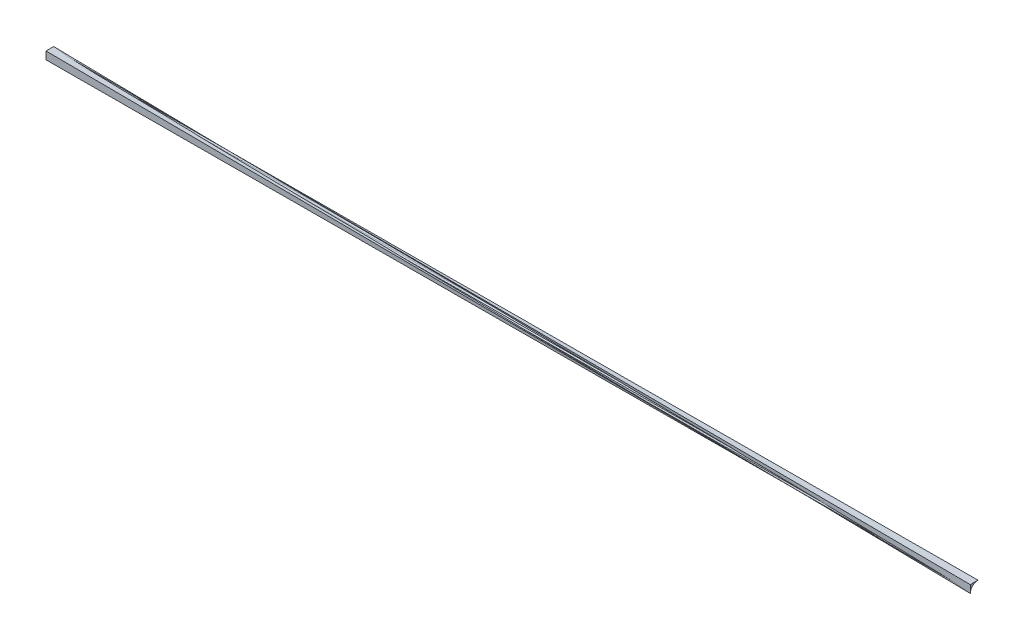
ISO-10303-21;
HEADER;
FILE_DESCRIPTION(('STEP AP214'),'2;1');
FILE_NAME('part.step','',(''),(''),'','','');
FILE_SCHEMA(('AUTOMOTIVE_DESIGN { 1 0 10303 214 1 1 1 1 }'));
ENDSEC;
DATA;
#1=APPLICATION_CONTEXT('core data for automotive mechanical design processes');
#2=APPLICATION_PROTOCOL_DEFINITION('international standard','automotive_design',2000,#1);
#3=PRODUCT_CONTEXT('',#1,'mechanical');
#4=PRODUCT('Part','Part','',(#3));
#5=PRODUCT_RELATED_PRODUCT_CATEGORY('part','',(#4));
#6=PRODUCT_DEFINITION_FORMATION('','',#4);
#7=PRODUCT_DEFINITION_CONTEXT('part definition',#1,'design');
#8=PRODUCT_DEFINITION('design','',#6,#7);
#9=PRODUCT_DEFINITION_SHAPE('','',#8);
#10=(LENGTH_UNIT() NAMED_UNIT(*) SI_UNIT(.MILLI.,.METRE.));
#11=(NAMED_UNIT(*) PLANE_ANGLE_UNIT() SI_UNIT($,.RADIAN.));
#12=(NAMED_UNIT(*) SI_UNIT($,.STERADIAN.) SOLID_ANGLE_UNIT());
#13=UNCERTAINTY_MEASURE_WITH_UNIT(LENGTH_MEASURE(1.E-05),#10,'distance_accuracy_value','');
#14=(GEOMETRIC_REPRESENTATION_CONTEXT(3) GLOBAL_UNCERTAINTY_ASSIGNED_CONTEXT((#13)) GLOBAL_UNIT_ASSIGNED_CONTEXT((#10,
#11,#12)) REPRESENTATION_CONTEXT('',''));
#15=CARTESIAN_POINT('',(0.,0.,0.));
#16=DIRECTION('',(0.,0.,1.));
#17=DIRECTION('',(1.,0.,0.));
#18=AXIS2_PLACEMENT_3D('',#15,#16,#17);
#19=CARTESIAN_POINT('',(304.8,0.,0.));
#20=DIRECTION('',(1.,0.,0.));
#21=DIRECTION('',(0.,0.,-1.));
#22=AXIS2_PLACEMENT_3D('',#19,#20,#21);
#23=PLANE('',#22);
#24=DIRECTION('',(0.,0.,1.));
#25=VECTOR('',#24,1.);
#26=CARTESIAN_POINT('',(304.8,76.2,73.025));
#27=LINE('',#26,#25);
#28=CARTESIAN_POINT('',(304.8,76.2,73.025));
#29=VERTEX_POINT('',#28);
#30=CARTESIAN_POINT('',(304.8,76.2,76.2));
#31=VERTEX_POINT('',#30);
#32=EDGE_CURVE('E48',#29,#31,#27,.T.);
#33=ORIENTED_EDGE('',*,*,#32,.T.);
#34=DIRECTION('',(0.,-1.,0.));
#35=VECTOR('',#34,1.);
#36=CARTESIAN_POINT('',(304.8,76.2,76.2));
#37=LINE('',#36,#35);
#38=CARTESIAN_POINT('',(304.8,73.025,76.2));
#39=VERTEX_POINT('',#38);
#40=EDGE_CURVE('E183',#31,#39,#37,.T.);
#41=ORIENTED_EDGE('',*,*,#40,.T.);
#42=DIRECTION('',(0.,0.995184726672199,-0.0980171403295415));
#43=VECTOR('',#42,1.);
#44=CARTESIAN_POINT('',(304.8,73.025,76.2));
#45=LINE('',#44,#43);
#46=CARTESIAN_POINT('',(304.8,73.6444117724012,76.1389932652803));
#47=VERTEX_POINT('',#46);
#48=EDGE_CURVE('E189',#39,#47,#45,.T.);
#49=ORIENTED_EDGE('',*,*,#48,.T.);
#50=DIRECTION('',(0.,0.956940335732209,-0.290284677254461));
#51=VECTOR('',#50,1.);
#52=CARTESIAN_POINT('',(304.8,73.6444117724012,76.1389932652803));
#53=LINE('',#52,#51);
#54=CARTESIAN_POINT('',(304.8,74.2400198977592,75.9583175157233));
#55=VERTEX_POINT('',#54);
#56=EDGE_CURVE('E150',#47,#55,#53,.T.);
#57=ORIENTED_EDGE('',*,*,#56,.T.);
#58=DIRECTION('',(0.,0.881921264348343,-0.47139673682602));
#59=VECTOR('',#58,1.);
#60=CARTESIAN_POINT('',(304.8,74.2400198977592,75.9583175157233));
#61=LINE('',#60,#59);
#62=CARTESIAN_POINT('',(304.8,74.7889354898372,75.6649160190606));
#63=VERTEX_POINT('',#62);
#64=EDGE_CURVE('E194',#55,#63,#61,.T.);
#65=ORIENTED_EDGE('',*,*,#64,.T.);
#66=DIRECTION('',(0.,0.773010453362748,-0.634393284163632));
#67=VECTOR('',#66,1.);
#68=CARTESIAN_POINT('',(304.8,74.7889354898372,75.6649160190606));
#69=LINE('',#68,#67);
#70=CARTESIAN_POINT('',(304.8,75.2700640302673,75.2700640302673));
#71=VERTEX_POINT('',#70);
#72=EDGE_CURVE('E197',#63,#71,#69,.T.);
#73=ORIENTED_EDGE('',*,*,#72,.T.);
#74=DIRECTION('',(0.,0.634393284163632,-0.773010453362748));
#75=VECTOR('',#74,1.);
#76=CARTESIAN_POINT('',(304.8,75.2700640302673,75.2700640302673));
#77=LINE('',#76,#75);
#78=CARTESIAN_POINT('',(304.8,75.6649160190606,74.7889354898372));
#79=VERTEX_POINT('',#78);
#80=EDGE_CURVE('E203',#71,#79,#77,.T.);
#81=ORIENTED_EDGE('',*,*,#80,.T.);
#82=DIRECTION('',(0.,0.47139673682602,-0.881921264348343));
#83=VECTOR('',#82,1.);
#84=CARTESIAN_POINT('',(304.8,75.6649160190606,74.7889354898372));
#85=LINE('',#84,#83);
#86=CARTESIAN_POINT('',(304.8,75.9583175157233,74.2400198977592));
#87=VERTEX_POINT('',#86);
#88=EDGE_CURVE('E202',#79,#87,#85,.T.);
#89=ORIENTED_EDGE('',*,*,#88,.T.);
#90=DIRECTION('',(0.,0.290284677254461,-0.956940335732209));
#91=VECTOR('',#90,1.);
#92=CARTESIAN_POINT('',(304.8,75.9583175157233,74.2400198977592));
#93=LINE('',#92,#91);
#94=CARTESIAN_POINT('',(304.8,76.1389932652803,73.6444117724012));
#95=VERTEX_POINT('',#94);
#96=EDGE_CURVE('E53',#87,#95,#93,.T.);
#97=ORIENTED_EDGE('',*,*,#96,.T.);
#98=DIRECTION('',(0.,0.0980171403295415,-0.995184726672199));
#99=VECTOR('',#98,1.);
#100=CARTESIAN_POINT('',(304.8,76.1389932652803,73.6444117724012));
#101=LINE('',#100,#99);
#102=EDGE_CURVE('E11',#95,#29,#101,.T.);
#103=ORIENTED_EDGE('',*,*,#102,.T.);
#104=EDGE_LOOP('',(#33,#41,#49,#57,#65,#73,#81,#89,#97,#103));
#105=FACE_BOUND('',#104,.T.);
#106=ADVANCED_FACE('F44',(#105),#23,.T.);
#107=CARTESIAN_POINT('',(0.,0.,0.));
#108=DIRECTION('',(1.,0.,0.));
#109=DIRECTION('',(0.,0.,-1.));
#110=AXIS2_PLACEMENT_3D('',#107,#108,#109);
#111=PLANE('',#110);
#112=DIRECTION('',(0.,0.,1.));
#113=VECTOR('',#112,1.);
#114=CARTESIAN_POINT('',(0.,152.4,149.225));
#115=LINE('',#114,#113);
#116=CARTESIAN_POINT('',(0.,152.4,149.225));
#117=VERTEX_POINT('',#116);
#118=CARTESIAN_POINT('',(0.,152.4,152.4));
#119=VERTEX_POINT('',#118);
#120=EDGE_CURVE('E122',#117,#119,#115,.T.);
#121=ORIENTED_EDGE('',*,*,#120,.F.);
#122=DIRECTION('',(0.,0.0980171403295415,-0.995184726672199));
#123=VECTOR('',#122,1.);
#124=CARTESIAN_POINT('',(0.,152.33899326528,149.844411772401));
#125=LINE('',#124,#123);
#126=CARTESIAN_POINT('',(0.,152.33899326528,149.844411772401));
#127=VERTEX_POINT('',#126);
#128=EDGE_CURVE('E156',#127,#117,#125,.T.);
#129=ORIENTED_EDGE('',*,*,#128,.F.);
#130=DIRECTION('',(0.,0.290284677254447,-0.956940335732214));
#131=VECTOR('',#130,1.);
#132=CARTESIAN_POINT('',(0.,152.158317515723,150.440019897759));
#133=LINE('',#132,#131);
#134=CARTESIAN_POINT('',(0.,152.158317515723,150.440019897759));
#135=VERTEX_POINT('',#134);
#136=EDGE_CURVE('E232',#135,#127,#133,.T.);
#137=ORIENTED_EDGE('',*,*,#136,.F.);
#138=DIRECTION('',(0.,0.47139673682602,-0.881921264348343));
#139=VECTOR('',#138,1.);
#140=CARTESIAN_POINT('',(0.,151.864916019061,150.988935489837));
#141=LINE('',#140,#139);
#142=CARTESIAN_POINT('',(0.,151.864916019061,150.988935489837));
#143=VERTEX_POINT('',#142);
#144=EDGE_CURVE('E227',#143,#135,#141,.T.);
#145=ORIENTED_EDGE('',*,*,#144,.F.);
#146=DIRECTION('',(0.,0.634393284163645,-0.773010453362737));
#147=VECTOR('',#146,1.);
#148=CARTESIAN_POINT('',(0.,151.470064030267,151.470064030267));
#149=LINE('',#148,#147);
#150=CARTESIAN_POINT('',(0.,151.470064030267,151.470064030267));
#151=VERTEX_POINT('',#150);
#152=EDGE_CURVE('E219',#151,#143,#149,.T.);
#153=ORIENTED_EDGE('',*,*,#152,.F.);
#154=DIRECTION('',(0.,0.773010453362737,-0.634393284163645));
#155=VECTOR('',#154,1.);
#156=CARTESIAN_POINT('',(0.,150.988935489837,151.864916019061));
#157=LINE('',#156,#155);
#158=CARTESIAN_POINT('',(0.,150.988935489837,151.864916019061));
#159=VERTEX_POINT('',#158);
#160=EDGE_CURVE('E220',#159,#151,#157,.T.);
#161=ORIENTED_EDGE('',*,*,#160,.F.);
#162=DIRECTION('',(0.,0.881921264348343,-0.47139673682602));
#163=VECTOR('',#162,1.);
#164=CARTESIAN_POINT('',(0.,150.440019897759,152.158317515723));
#165=LINE('',#164,#163);
#166=CARTESIAN_POINT('',(0.,150.440019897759,152.158317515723));
#167=VERTEX_POINT('',#166);
#168=EDGE_CURVE('E222',#167,#159,#165,.T.);
#169=ORIENTED_EDGE('',*,*,#168,.F.);
#170=DIRECTION('',(0.,0.956940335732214,-0.290284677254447));
#171=VECTOR('',#170,1.);
#172=CARTESIAN_POINT('',(0.,149.844411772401,152.33899326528));
#173=LINE('',#172,#171);
#174=CARTESIAN_POINT('',(0.,149.844411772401,152.33899326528));
#175=VERTEX_POINT('',#174);
#176=EDGE_CURVE('E229',#175,#167,#173,.T.);
#177=ORIENTED_EDGE('',*,*,#176,.F.);
#178=DIRECTION('',(0.,0.995184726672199,-0.0980171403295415));
#179=VECTOR('',#178,1.);
#180=CARTESIAN_POINT('',(0.,149.225,152.4));
#181=LINE('',#180,#179);
#182=CARTESIAN_POINT('',(0.,149.225,152.4));
#183=VERTEX_POINT('',#182);
#184=EDGE_CURVE('E130',#183,#175,#181,.T.);
#185=ORIENTED_EDGE('',*,*,#184,.F.);
#186=DIRECTION('',(0.,-1.,0.));
#187=VECTOR('',#186,1.);
#188=CARTESIAN_POINT('',(0.,152.4,152.4));
#189=LINE('',#188,#187);
#190=EDGE_CURVE('E121',#119,#183,#189,.T.);
#191=ORIENTED_EDGE('',*,*,#190,.F.);
#192=EDGE_LOOP('',(#121,#129,#137,#145,#153,#161,#169,#177,#185,#191));
#193=FACE_BOUND('',#192,.T.);
#194=ADVANCED_FACE('F123',(#193),#111,.F.);
#195=CARTESIAN_POINT('',(0.,152.4,149.225));
#196=CARTESIAN_POINT('',(304.8,73.025,76.2));
#197=CARTESIAN_POINT('',(0.,152.4,149.754166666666));
#198=CARTESIAN_POINT('',(304.8,73.1282352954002,76.18983221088));
#199=CARTESIAN_POINT('',(0.,152.4,150.283333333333));
#200=CARTESIAN_POINT('',(304.8,73.2314705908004,76.1796644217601));
#201=CARTESIAN_POINT('',(0.,152.4,151.341666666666));
#202=CARTESIAN_POINT('',(304.8,73.4379411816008,76.1593288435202));
#203=CARTESIAN_POINT('',(0.,152.4,151.870833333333));
#204=CARTESIAN_POINT('',(304.8,73.541176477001,76.1491610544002));
#205=CARTESIAN_POINT('',(0.,152.4,152.4));
#206=CARTESIAN_POINT('',(304.8,73.6444117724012,76.1389932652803));
#207=B_SPLINE_SURFACE_WITH_KNOTS('',3,1,((#195,#196),(#197,#198),(#199,#200),(#201,#202),(#203,
#204),(#205,#206)),.UNSPECIFIED.,.F.,.F.,.F.,(4,2,4),(2,2),(0.,0.5,1.),(0.,1.),.UNSPECIFIED.);
#208=DIRECTION('',(0.940986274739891,-0.243136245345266,-0.23543491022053));
#209=VECTOR('',#208,1.);
#210=CARTESIAN_POINT('',(152.4,113.022205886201,114.26949663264));
#211=LINE('',#210,#209);
#212=EDGE_CURVE('E139',#119,#47,#211,.T.);
#213=DIRECTION('',(-0.942718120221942,0.245499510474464,0.225859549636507));
#214=VECTOR('',#213,1.);
#215=CARTESIAN_POINT('',(152.4,112.7125,112.7125));
#216=LINE('',#215,#214);
#217=EDGE_CURVE('E143',#39,#117,#216,.T.);
#218=ORIENTED_EDGE('',*,*,#120,.T.);
#219=ORIENTED_EDGE('',*,*,#212,.T.);
#220=ORIENTED_EDGE('',*,*,#48,.F.);
#221=ORIENTED_EDGE('',*,*,#217,.T.);
#222=EDGE_LOOP('',(#218,#219,#220,#221));
#223=FACE_BOUND('',#222,.T.);
#224=ADVANCED_FACE('F137',(#223),#207,.T.);
#225=CARTESIAN_POINT('',(0.,152.4,152.4));
#226=CARTESIAN_POINT('',(304.8,73.6444117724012,76.1389932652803));
#227=CARTESIAN_POINT('',(0.,151.870833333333,152.4));
#228=CARTESIAN_POINT('',(304.8,73.7436797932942,76.1088806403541));
#229=CARTESIAN_POINT('',(0.,151.341666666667,152.4));
#230=CARTESIAN_POINT('',(304.8,73.8429478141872,76.0787680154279));
#231=CARTESIAN_POINT('',(0.,150.283333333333,152.4));
#232=CARTESIAN_POINT('',(304.8,74.0414838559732,76.0185427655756));
#233=CARTESIAN_POINT('',(0.,149.754166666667,152.4));
#234=CARTESIAN_POINT('',(304.8,74.1407518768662,75.9884301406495));
#235=CARTESIAN_POINT('',(0.,149.225,152.4));
#236=CARTESIAN_POINT('',(304.8,74.2400198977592,75.9583175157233));
#237=B_SPLINE_SURFACE_WITH_KNOTS('',3,1,((#225,#226),(#227,#228),(#229,#230),(#231,#232),(#233,
#234),(#235,#236)),.UNSPECIFIED.,.F.,.F.,.F.,(4,2,4),(2,2),(0.,0.5,1.),(0.,1.),.UNSPECIFIED.);
#238=DIRECTION('',(0.943471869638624,-0.232107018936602,-0.236616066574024));
#239=VECTOR('',#238,1.);
#240=CARTESIAN_POINT('',(152.4,111.73250994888,114.179158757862));
#241=LINE('',#240,#239);
#242=EDGE_CURVE('E149',#183,#55,#241,.T.);
#243=ORIENTED_EDGE('',*,*,#190,.T.);
#244=ORIENTED_EDGE('',*,*,#242,.T.);
#245=ORIENTED_EDGE('',*,*,#56,.F.);
#246=ORIENTED_EDGE('',*,*,#212,.F.);
#247=EDGE_LOOP('',(#243,#244,#245,#246));
#248=FACE_BOUND('',#247,.T.);
#249=ADVANCED_FACE('F144',(#248),#237,.T.);
#250=CARTESIAN_POINT('',(0.,152.33899326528,149.844411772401));
#251=CARTESIAN_POINT('',(304.8,76.2,76.2));
#252=CARTESIAN_POINT('',(0.,152.3491610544,149.741176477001));
#253=CARTESIAN_POINT('',(304.8,75.6708333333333,76.2));
#254=CARTESIAN_POINT('',(0.,152.35932884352,149.637941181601));
#255=CARTESIAN_POINT('',(304.8,75.1416666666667,76.2));
#256=CARTESIAN_POINT('',(0.,152.37966442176,149.4314705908));
#257=CARTESIAN_POINT('',(304.8,74.0833333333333,76.2));
#258=CARTESIAN_POINT('',(0.,152.38983221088,149.3282352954));
#259=CARTESIAN_POINT('',(304.8,73.5541666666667,76.2));
#260=CARTESIAN_POINT('',(0.,152.4,149.225));
#261=CARTESIAN_POINT('',(304.8,73.025,76.2));
#262=B_SPLINE_SURFACE_WITH_KNOTS('',3,1,((#250,#251),(#252,#253),(#254,#255),(#256,#257),(#258,
#259),(#260,#261)),.UNSPECIFIED.,.F.,.F.,.F.,(4,2,4),(2,2),(0.,0.5,1.),(0.,1.),.UNSPECIFIED.);
#263=DIRECTION('',(0.944583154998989,-0.235956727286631,-0.228225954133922));
#264=VECTOR('',#263,1.);
#265=CARTESIAN_POINT('',(152.4,114.26949663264,113.022205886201));
#266=LINE('',#265,#264);
#267=EDGE_CURVE('E182',#127,#31,#266,.T.);
#268=ORIENTED_EDGE('',*,*,#128,.T.);
#269=ORIENTED_EDGE('',*,*,#217,.F.);
#270=ORIENTED_EDGE('',*,*,#40,.F.);
#271=ORIENTED_EDGE('',*,*,#267,.F.);
#272=EDGE_LOOP('',(#268,#269,#270,#271));
#273=FACE_BOUND('',#272,.T.);
#274=ADVANCED_FACE('F245',(#273),#262,.T.);
#275=CARTESIAN_POINT('',(0.,149.225,152.4));
#276=CARTESIAN_POINT('',(304.8,74.2400198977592,75.9583175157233));
#277=CARTESIAN_POINT('',(0.,149.3282352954,152.38983221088));
#278=CARTESIAN_POINT('',(304.8,74.3315058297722,75.9094172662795));
#279=CARTESIAN_POINT('',(0.,149.4314705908,152.37966442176));
#280=CARTESIAN_POINT('',(304.8,74.4229917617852,75.8605170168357));
#281=CARTESIAN_POINT('',(0.,149.637941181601,152.35932884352));
#282=CARTESIAN_POINT('',(304.8,74.6059636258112,75.7627165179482));
#283=CARTESIAN_POINT('',(0.,149.741176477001,152.3491610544));
#284=CARTESIAN_POINT('',(304.8,74.6974495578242,75.7138162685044));
#285=CARTESIAN_POINT('',(0.,149.844411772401,152.33899326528));
#286=CARTESIAN_POINT('',(304.8,74.7889354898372,75.6649160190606));
#287=B_SPLINE_SURFACE_WITH_KNOTS('',3,1,((#275,#276),(#277,#278),(#279,#280),(#281,#282),(#283,
#284),(#285,#286)),.UNSPECIFIED.,.F.,.F.,.F.,(4,2,4),(2,2),(0.,0.5,1.),(0.,1.),.UNSPECIFIED.);
#288=DIRECTION('',(0.943263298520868,-0.232273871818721,-0.237282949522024));
#289=VECTOR('',#288,1.);
#290=CARTESIAN_POINT('',(152.4,112.316673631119,114.00195464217));
#291=LINE('',#290,#289);
#292=EDGE_CURVE('E152',#175,#63,#291,.T.);
#293=ORIENTED_EDGE('',*,*,#184,.T.);
#294=ORIENTED_EDGE('',*,*,#292,.T.);
#295=ORIENTED_EDGE('',*,*,#64,.F.);
#296=ORIENTED_EDGE('',*,*,#242,.F.);
#297=EDGE_LOOP('',(#293,#294,#295,#296));
#298=FACE_BOUND('',#297,.T.);
#299=ADVANCED_FACE('F292',(#298),#287,.T.);
#300=CARTESIAN_POINT('',(0.,149.844411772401,152.33899326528));
#301=CARTESIAN_POINT('',(304.8,74.7889354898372,75.6649160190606));
#302=CARTESIAN_POINT('',(0.,149.943679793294,152.308880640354));
#303=CARTESIAN_POINT('',(304.8,74.8691235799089,75.5991073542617));
#304=CARTESIAN_POINT('',(0.,150.042947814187,152.278768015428));
#305=CARTESIAN_POINT('',(304.8,74.9493116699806,75.5332986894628));
#306=CARTESIAN_POINT('',(0.,150.241483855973,152.218542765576));
#307=CARTESIAN_POINT('',(304.8,75.1096878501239,75.4016813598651));
#308=CARTESIAN_POINT('',(0.,150.340751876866,152.18843014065));
#309=CARTESIAN_POINT('',(304.8,75.1898759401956,75.3358726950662));
#310=CARTESIAN_POINT('',(0.,150.440019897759,152.158317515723));
#311=CARTESIAN_POINT('',(304.8,75.2700640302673,75.2700640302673));
#312=B_SPLINE_SURFACE_WITH_KNOTS('',3,1,((#300,#301),(#302,#303),(#304,#305),(#306,#307),(#308,
#309),(#310,#311)),.UNSPECIFIED.,.F.,.F.,.F.,(4,2,4),(2,2),(0.,0.5,1.),(0.,1.),.UNSPECIFIED.);
#313=DIRECTION('',(0.943037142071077,-0.232572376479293,-0.237888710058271));
#314=VECTOR('',#313,1.);
#315=CARTESIAN_POINT('',(152.4,112.855041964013,113.714190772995));
#316=LINE('',#315,#314);
#317=EDGE_CURVE('E162',#167,#71,#316,.T.);
#318=ORIENTED_EDGE('',*,*,#176,.T.);
#319=ORIENTED_EDGE('',*,*,#317,.T.);
#320=ORIENTED_EDGE('',*,*,#72,.F.);
#321=ORIENTED_EDGE('',*,*,#292,.F.);
#322=EDGE_LOOP('',(#318,#319,#320,#321));
#323=FACE_BOUND('',#322,.T.);
#324=ADVANCED_FACE('F302',(#323),#312,.T.);
#325=CARTESIAN_POINT('',(0.,150.440019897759,152.158317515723));
#326=CARTESIAN_POINT('',(304.8,75.2700640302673,75.2700640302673));
#327=CARTESIAN_POINT('',(0.,150.531505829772,152.10941726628));
#328=CARTESIAN_POINT('',(304.8,75.3358726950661,75.1898759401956));
#329=CARTESIAN_POINT('',(0.,150.622991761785,152.060517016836));
#330=CARTESIAN_POINT('',(304.8,75.401681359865,75.1096878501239));
#331=CARTESIAN_POINT('',(0.,150.805963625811,151.962716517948));
#332=CARTESIAN_POINT('',(304.8,75.5332986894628,74.9493116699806));
#333=CARTESIAN_POINT('',(0.,150.897449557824,151.913816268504));
#334=CARTESIAN_POINT('',(304.8,75.5991073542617,74.8691235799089));
#335=CARTESIAN_POINT('',(0.,150.988935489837,151.864916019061));
#336=CARTESIAN_POINT('',(304.8,75.6649160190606,74.7889354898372));
#337=B_SPLINE_SURFACE_WITH_KNOTS('',3,1,((#325,#326),(#327,#328),(#329,#330),(#331,#332),(#333,
#334),(#335,#336)),.UNSPECIFIED.,.F.,.F.,.F.,(4,2,4),(2,2),(0.,0.5,1.),(0.,1.),.UNSPECIFIED.);
#338=DIRECTION('',(0.942802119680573,-0.232990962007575,-0.238410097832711));
#339=VECTOR('',#338,1.);
#340=CARTESIAN_POINT('',(152.4,113.326925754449,113.326925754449));
#341=LINE('',#340,#339);
#342=EDGE_CURVE('E170',#159,#79,#341,.T.);
#343=ORIENTED_EDGE('',*,*,#168,.T.);
#344=ORIENTED_EDGE('',*,*,#342,.T.);
#345=ORIENTED_EDGE('',*,*,#80,.F.);
#346=ORIENTED_EDGE('',*,*,#317,.F.);
#347=EDGE_LOOP('',(#343,#344,#345,#346));
#348=FACE_BOUND('',#347,.T.);
#349=ADVANCED_FACE('F315',(#348),#337,.T.);
#350=CARTESIAN_POINT('',(0.,150.988935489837,151.864916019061));
#351=CARTESIAN_POINT('',(304.8,75.6649160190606,74.7889354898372));
#352=CARTESIAN_POINT('',(0.,151.069123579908,151.799107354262));
#353=CARTESIAN_POINT('',(304.8,75.7138162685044,74.6974495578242));
#354=CARTESIAN_POINT('',(0.,151.14931166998,151.733298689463));
#355=CARTESIAN_POINT('',(304.8,75.7627165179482,74.6059636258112));
#356=CARTESIAN_POINT('',(0.,151.309687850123,151.601681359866));
#357=CARTESIAN_POINT('',(304.8,75.8605170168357,74.4229917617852));
#358=CARTESIAN_POINT('',(0.,151.389875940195,151.535872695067));
#359=CARTESIAN_POINT('',(304.8,75.9094172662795,74.3315058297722));
#360=CARTESIAN_POINT('',(0.,151.470064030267,151.470064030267));
#361=CARTESIAN_POINT('',(304.8,75.9583175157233,74.2400198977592));
#362=B_SPLINE_SURFACE_WITH_KNOTS('',3,1,((#350,#351),(#352,#353),(#354,#355),(#356,#357),(#358,
#359),(#360,#361)),.UNSPECIFIED.,.F.,.F.,.F.,(4,2,4),(2,2),(0.,0.5,1.),(0.,1.),.UNSPECIFIED.);
#363=DIRECTION('',(0.94256727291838,-0.233513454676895,-0.238827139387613));
#364=VECTOR('',#363,1.);
#365=CARTESIAN_POINT('',(152.4,113.714190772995,112.855041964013));
#366=LINE('',#365,#364);
#367=EDGE_CURVE('E172',#151,#87,#366,.T.);
#368=ORIENTED_EDGE('',*,*,#160,.T.);
#369=ORIENTED_EDGE('',*,*,#367,.T.);
#370=ORIENTED_EDGE('',*,*,#88,.F.);
#371=ORIENTED_EDGE('',*,*,#342,.F.);
#372=EDGE_LOOP('',(#368,#369,#370,#371));
#373=FACE_BOUND('',#372,.T.);
#374=ADVANCED_FACE('F214',(#373),#362,.T.);
#375=CARTESIAN_POINT('',(0.,151.470064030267,151.470064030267));
#376=CARTESIAN_POINT('',(304.8,75.9583175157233,74.2400198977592));
#377=CARTESIAN_POINT('',(0.,151.535872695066,151.389875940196));
#378=CARTESIAN_POINT('',(304.8,75.9884301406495,74.1407518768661));
#379=CARTESIAN_POINT('',(0.,151.601681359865,151.309687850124));
#380=CARTESIAN_POINT('',(304.8,76.0185427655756,74.0414838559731));
#381=CARTESIAN_POINT('',(0.,151.733298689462,151.149311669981));
#382=CARTESIAN_POINT('',(304.8,76.078768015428,73.8429478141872));
#383=CARTESIAN_POINT('',(0.,151.799107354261,151.069123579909));
#384=CARTESIAN_POINT('',(304.8,76.1088806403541,73.7436797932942));
#385=CARTESIAN_POINT('',(0.,151.864916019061,150.988935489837));
#386=CARTESIAN_POINT('',(304.8,76.1389932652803,73.6444117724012));
#387=B_SPLINE_SURFACE_WITH_KNOTS('',3,1,((#375,#376),(#377,#378),(#379,#380),(#381,#382),(#383,
#384),(#385,#386)),.UNSPECIFIED.,.F.,.F.,.F.,(4,2,4),(2,2),(0.,0.5,1.),(0.,1.),.UNSPECIFIED.);
#388=DIRECTION('',(0.942341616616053,-0.234119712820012,-0.239123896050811));
#389=VECTOR('',#388,1.);
#390=CARTESIAN_POINT('',(152.4,114.00195464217,112.316673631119));
#391=LINE('',#390,#389);
#392=EDGE_CURVE('E66',#143,#95,#391,.T.);
#393=ORIENTED_EDGE('',*,*,#152,.T.);
#394=ORIENTED_EDGE('',*,*,#392,.T.);
#395=ORIENTED_EDGE('',*,*,#96,.F.);
#396=ORIENTED_EDGE('',*,*,#367,.F.);
#397=EDGE_LOOP('',(#393,#394,#395,#396));
#398=FACE_BOUND('',#397,.T.);
#399=ADVANCED_FACE('F215',(#398),#387,.T.);
#400=CARTESIAN_POINT('',(0.,151.864916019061,150.988935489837));
#401=CARTESIAN_POINT('',(304.8,76.1389932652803,73.6444117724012));
#402=CARTESIAN_POINT('',(0.,151.913816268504,150.897449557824));
#403=CARTESIAN_POINT('',(304.8,76.1491610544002,73.541176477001));
#404=CARTESIAN_POINT('',(0.,151.962716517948,150.805963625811));
#405=CARTESIAN_POINT('',(304.8,76.1593288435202,73.4379411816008));
#406=CARTESIAN_POINT('',(0.,152.060517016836,150.622991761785));
#407=CARTESIAN_POINT('',(304.8,76.1796644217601,73.2314705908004));
#408=CARTESIAN_POINT('',(0.,152.10941726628,150.531505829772));
#409=CARTESIAN_POINT('',(304.8,76.18983221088,73.1282352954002));
#410=CARTESIAN_POINT('',(0.,152.158317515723,150.440019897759));
#411=CARTESIAN_POINT('',(304.8,76.2,73.025));
#412=B_SPLINE_SURFACE_WITH_KNOTS('',3,1,((#400,#401),(#402,#403),(#404,#405),(#406,#407),(#408,
#409),(#410,#411)),.UNSPECIFIED.,.F.,.F.,.F.,(4,2,4),(2,2),(0.,0.5,1.),(0.,1.),.UNSPECIFIED.);
#413=DIRECTION('',(0.942133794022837,-0.234786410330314,-0.239289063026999));
#414=VECTOR('',#413,1.);
#415=CARTESIAN_POINT('',(152.4,114.179158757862,111.73250994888));
#416=LINE('',#415,#414);
#417=EDGE_CURVE('E176',#135,#29,#416,.T.);
#418=ORIENTED_EDGE('',*,*,#144,.T.);
#419=ORIENTED_EDGE('',*,*,#417,.T.);
#420=ORIENTED_EDGE('',*,*,#102,.F.);
#421=ORIENTED_EDGE('',*,*,#392,.F.);
#422=EDGE_LOOP('',(#418,#419,#420,#421));
#423=FACE_BOUND('',#422,.T.);
#424=ADVANCED_FACE('F249',(#423),#412,.T.);
#425=CARTESIAN_POINT('',(0.,152.158317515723,150.440019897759));
#426=CARTESIAN_POINT('',(304.8,76.2,73.025));
#427=CARTESIAN_POINT('',(0.,152.18843014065,150.340751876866));
#428=CARTESIAN_POINT('',(304.8,76.2,73.5541666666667));
#429=CARTESIAN_POINT('',(0.,152.218542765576,150.241483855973));
#430=CARTESIAN_POINT('',(304.8,76.2,74.0833333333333));
#431=CARTESIAN_POINT('',(0.,152.278768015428,150.042947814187));
#432=CARTESIAN_POINT('',(304.8,76.2,75.1416666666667));
#433=CARTESIAN_POINT('',(0.,152.308880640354,149.943679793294));
#434=CARTESIAN_POINT('',(304.8,76.2,75.6708333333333));
#435=CARTESIAN_POINT('',(0.,152.33899326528,149.844411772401));
#436=CARTESIAN_POINT('',(304.8,76.2,76.2));
#437=B_SPLINE_SURFACE_WITH_KNOTS('',3,1,((#425,#426),(#427,#428),(#429,#430),(#431,#432),(#433,
#434),(#435,#436)),.UNSPECIFIED.,.F.,.F.,.F.,(4,2,4),(2,2),(0.,0.5,1.),(0.,1.),.UNSPECIFIED.);
#438=ORIENTED_EDGE('',*,*,#136,.T.);
#439=ORIENTED_EDGE('',*,*,#267,.T.);
#440=ORIENTED_EDGE('',*,*,#32,.F.);
#441=ORIENTED_EDGE('',*,*,#417,.F.);
#442=EDGE_LOOP('',(#438,#439,#440,#441));
#443=FACE_BOUND('',#442,.T.);
#444=ADVANCED_FACE('F247',(#443),#437,.T.);
#445=CLOSED_SHELL('',(#106,#194,#224,#249,#274,#299,#324,#349,#374,#399,#424,#444));
#446=MANIFOLD_SOLID_BREP('B2',#445);
#447=ADVANCED_BREP_SHAPE_REPRESENTATION('',(#18,#446),#14);
#448=SHAPE_DEFINITION_REPRESENTATION(#9,#447);
ENDSEC;
END-ISO-10303-21;
